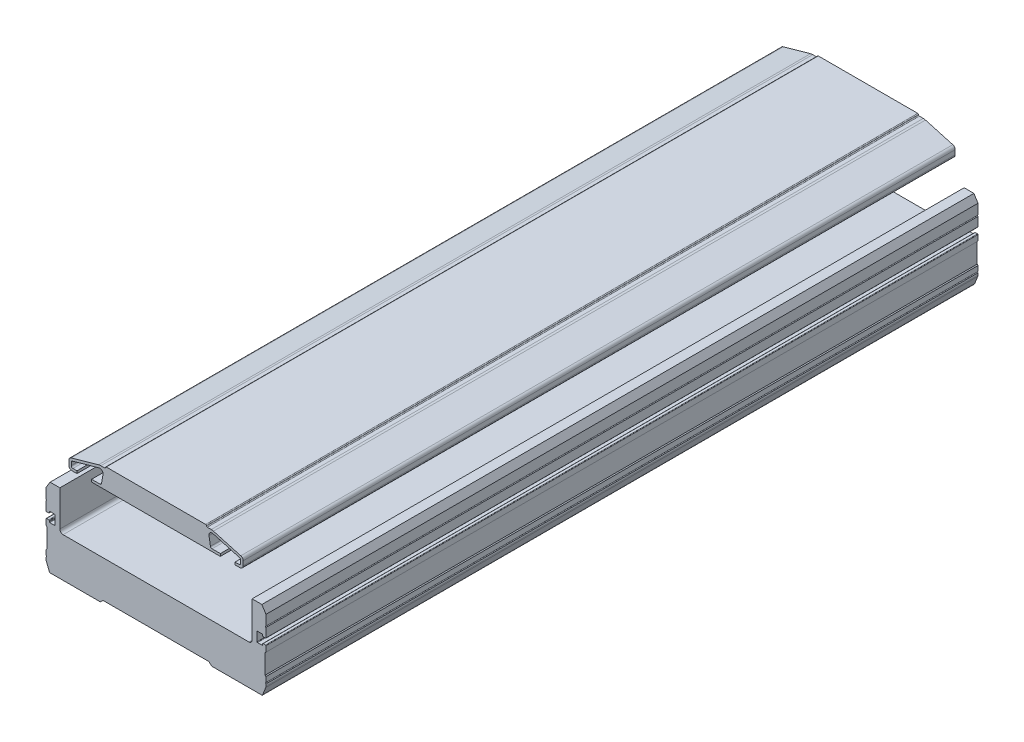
from build123d import *

# Parameters (mm, degrees)
EXTRUDE_1_DEPTH             = 437
EXTRUDE_1_2_DEPTH           = 437
HOLE_WIZARD_1_AT_2_COUNT    = 2
HOLE_WIZARD_1_AT_2_PITCH    = 106
HOLE_WIZARD_1_AT_3_COUNT    = 2
HOLE_WIZARD_1_AT_3_PITCH    = 145.725769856
HOLE_WIZARD_1_AT_4_COUNT    = 2
HOLE_WIZARD_1_AT_4_PITCH    = 100
HOLE_WIZARD_1_AT_5_COUNT    = 2
HOLE_WIZARD_1_AT_5_PITCH    = 318.176051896
HOLE_WIZARD_1_AT_6_COUNT    = 2
HOLE_WIZARD_1_AT_6_PITCH    = 300
HOLE_WIZARD_M6_0_AT_2_COUNT = 2
HOLE_WIZARD_M6_0_AT_2_PITCH = 106
HOLE_WIZARD_M6_0_AT_3_COUNT = 2
HOLE_WIZARD_M6_0_AT_3_PITCH = 100
HOLE_WIZARD_M6_0_AT_4_COUNT = 2
HOLE_WIZARD_M6_0_AT_4_PITCH = 145.725769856
HOLE_WIZARD_M6_0_AT_5_COUNT = 2
HOLE_WIZARD_M6_0_AT_5_PITCH = 318.176051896
HOLE_WIZARD_M6_0_AT_6_COUNT = 2
HOLE_WIZARD_M6_0_AT_6_PITCH = 300


with BuildPart() as part:
    # Sketch 1 → Extrude 1 (new body)
    with BuildSketch(Plane.XY):
        with BuildLine():
            Line((-39.5, 59.4), (39.5, 59.4))
            Line((39.5, 59.4), (39.5, 60.9))
            Line((39.5, 60.9), (34.4, 60.9))
            ThreePointArc((34.4, 60.9), (33.754110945, 61.136568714), (33.413816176, 61.734345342))
            Line((33.413816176, 61.734345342), (32.536146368, 66.959334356))
            ThreePointArc((32.536146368, 66.959334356), (33.171932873, 68.778444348), (35.048529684, 69.216359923))
            Line((35.048529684, 69.216359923), (51.270007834, 64.667479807))
            ThreePointArc((51.270007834, 64.667479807), (51.79687133, 64.308770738), (52, 63.704621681))
            Line((52, 63.704621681), (52, 61.9))
            ThreePointArc((52, 61.9), (51.707106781, 61.192893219), (51, 60.9))
            Line((51, 60.9), (48.5, 60.9))
            Line((48.5, 60.9), (48.5, 59.4))
            Line((48.5, 59.4), (51.5, 59.4))
            ThreePointArc((51.5, 59.4), (52.914213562, 59.985786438), (53.5, 61.4))
            Line((53.5, 61.4), (53.5, 64.083697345))
            ThreePointArc((53.5, 64.083697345), (53.093742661, 65.291995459), (52.040015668, 66.009413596))
            Line((52.040015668, 66.009413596), (35.262246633, 70.714290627))
            ThreePointArc((35.262246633, 70.714290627), (34.593583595, 70.853355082), (33.912207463, 70.9))
            Line((33.912207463, 70.9), (31.5, 70.9))
            ThreePointArc((31.5, 70.9), (31.146446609, 71.046446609), (31, 71.4))
            ThreePointArc((31, 71.4), (30.853553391, 71.753553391), (30.5, 71.9))
            Line((30.5, 71.9), (-30.5, 71.9))
            ThreePointArc((-30.5, 71.9), (-30.853553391, 71.753553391), (-31, 71.4))
            ThreePointArc((-31, 71.4), (-31.146446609, 71.046446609), (-31.5, 70.9))
            Line((-31.5, 70.9), (-33.912207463, 70.9))
            ThreePointArc((-33.912207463, 70.9), (-34.593583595, 70.853355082), (-35.262246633, 70.714290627))
            Line((-35.262246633, 70.714290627), (-52.040015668, 66.009413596))
            ThreePointArc((-52.040015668, 66.009413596), (-53.093742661, 65.291995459), (-53.5, 64.083697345))
            Line((-53.5, 64.083697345), (-53.5, 61.4))
            ThreePointArc((-53.5, 61.4), (-52.914213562, 59.985786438), (-51.5, 59.4))
            Line((-51.5, 59.4), (-48.5, 59.4))
            Line((-48.5, 59.4), (-48.5, 60.9))
            Line((-48.5, 60.9), (-51, 60.9))
            ThreePointArc((-51, 60.9), (-51.707106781, 61.192893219), (-52, 61.9))
            Line((-52, 61.9), (-52, 63.704621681))
            ThreePointArc((-52, 63.704621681), (-51.79687133, 64.308770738), (-51.270007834, 64.667479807))
            Line((-51.270007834, 64.667479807), (-35.048529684, 69.216359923))
            ThreePointArc((-35.048529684, 69.216359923), (-33.171932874, 68.778444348), (-32.536146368, 66.959334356))
            Line((-32.536146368, 66.959334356), (-33.413816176, 61.734345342))
            ThreePointArc((-33.413816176, 61.734345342), (-33.754110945, 61.136568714), (-34.4, 60.9))
            Line((-34.4, 60.9), (-39.5, 60.9))
            Line((-39.5, 60.9), (-39.5, 59.4))
        make_face()
    extrude(amount=-EXTRUDE_1_DEPTH)


with BuildPart() as body_2:
    # Sketch 1 → Extrude 1 2 (new body)
    with BuildSketch(Plane.XY):
        with BuildLine():
            Line((-67, 22), (-67, 10))
            Line((-67, 10), (-67.5, 9.5))
            Line((-67.5, 9.5), (-67.5, 6.375))
            ThreePointArc((-67.5, 6.375), (-67.125, 6), (-67.5, 5.625))
            Line((-67.5, 5.625), (-67.49999984, 4.381168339))
            ThreePointArc((-67.49999984, 4.381168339), (-67.464614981, 4.007418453), (-67.360006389, 3.646865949))
            Line((-67.360006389, 3.646865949), (-65.506419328, -1.028852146))
            ThreePointArc((-65.506419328, -1.028852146), (-65.35722349, -1.328991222), (-65.16, -1.6))
            Line((-65.16, -1.6), (-34.1, -1.6))
            Line((-34.1, -1.6), (-32.5, 0))
            Line((-32.5, 0), (32.5, 0))
            Line((32.5, 0), (34.1, -1.6))
            Line((34.1, -1.6), (65.16, -1.6))
            ThreePointArc((65.16, -1.6), (65.35722349, -1.328991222), (65.506419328, -1.028852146))
            Line((65.506419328, -1.028852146), (67.360006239, 3.646865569))
            ThreePointArc((67.360006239, 3.646865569), (67.464614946, 4.007418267), (67.499999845, 4.381168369))
            Line((67.499999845, 4.381168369), (67.499999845, 5.625000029))
            ThreePointArc((67.499999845, 5.625000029), (67.124999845, 6.000000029), (67.499999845, 6.375000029))
            Line((67.499999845, 6.375000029), (67.499999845, 9.500000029))
            Line((67.499999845, 9.500000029), (66.999999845, 10.000000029))
            Line((66.999999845, 10.000000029), (66.999999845, 22.000000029))
            Line((66.999999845, 22.000000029), (67.499999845, 22.500000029))
            Line((67.499999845, 22.500000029), (67.499999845, 25.900000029))
            ThreePointArc((67.499999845, 25.900000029), (67.41213188, 26.112132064), (67.199999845, 26.200000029))
            Line((67.199999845, 26.200000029), (65.799999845, 26.200000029))
            ThreePointArc((65.799999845, 26.200000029), (65.587867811, 26.112132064), (65.499999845, 25.900000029))
            Line((65.499999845, 25.900000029), (65.499999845, 25.300000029))
            ThreePointArc((65.499999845, 25.300000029), (65.41213188, 25.087867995), (65.199999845, 25.000000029))
            Line((65.199999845, 25.000000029), (62.299999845, 25.000000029))
            ThreePointArc((62.299999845, 25.000000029), (62.087867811, 25.087867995), (61.999999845, 25.300000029))
            Line((61.999999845, 25.300000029), (61.999999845, 30.700000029))
            ThreePointArc((61.999999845, 30.700000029), (62.087867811, 30.912132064), (62.299999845, 31.000000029))
            Line((62.299999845, 31.000000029), (65.199999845, 31.000000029))
            ThreePointArc((65.199999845, 31.000000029), (65.41213188, 30.912132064), (65.499999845, 30.700000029))
            Line((65.499999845, 30.700000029), (65.499999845, 30.100000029))
            ThreePointArc((65.499999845, 30.100000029), (65.587867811, 29.887867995), (65.799999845, 29.800000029))
            Line((65.799999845, 29.800000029), (67.199999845, 29.800000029))
            ThreePointArc((67.199999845, 29.800000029), (67.41213188, 29.887867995), (67.499999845, 30.100000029))
            Line((67.499999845, 30.100000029), (67.499999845, 35.625000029))
            ThreePointArc((67.499999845, 35.625000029), (67.124999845, 36.000000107), (67.5, 36.375000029))
            Line((67.5, 36.375000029), (67.5, 42.6))
            Line((67.5, 42.6), (65, 46.6))
            Line((65, 46.6), (59, 46.6))
            Line((59, 46.6), (59, 24.7))
            ThreePointArc((59, 24.7), (58.414213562, 23.285786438), (57, 22.7))
            Line((57, 22.7), (-57, 22.7))
            ThreePointArc((-57, 22.7), (-58.414213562, 23.285786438), (-59, 24.7))
            Line((-59, 24.7), (-59, 46.6))
            Line((-59, 46.6), (-65, 46.6))
            Line((-65, 46.6), (-67.5, 42.6))
            Line((-67.5, 42.6), (-67.5, 36.375))
            ThreePointArc((-67.5, 36.375), (-67.125, 36), (-67.5, 35.625))
            Line((-67.5, 35.625), (-67.5, 30.1))
            ThreePointArc((-67.5, 30.1), (-67.412132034, 29.887867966), (-67.2, 29.8))
            Line((-67.2, 29.8), (-65.8, 29.8))
            ThreePointArc((-65.8, 29.8), (-65.587867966, 29.887867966), (-65.5, 30.1))
            Line((-65.5, 30.1), (-65.5, 30.7))
            ThreePointArc((-65.5, 30.7), (-65.412132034, 30.912132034), (-65.2, 31))
            Line((-65.2, 31), (-62.3, 31))
            ThreePointArc((-62.3, 31), (-62.087867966, 30.912132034), (-62, 30.7))
            Line((-62, 30.7), (-62, 25.3))
            ThreePointArc((-62, 25.3), (-62.087867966, 25.087867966), (-62.3, 25))
            Line((-62.3, 25), (-65.2, 25))
            ThreePointArc((-65.2, 25), (-65.412132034, 25.087867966), (-65.5, 25.3))
            Line((-65.5, 25.3), (-65.5, 25.9))
            ThreePointArc((-65.5, 25.9), (-65.587867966, 26.112132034), (-65.8, 26.2))
            Line((-65.8, 26.2), (-67.2, 26.2))
            ThreePointArc((-67.2, 26.2), (-67.412132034, 26.112132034), (-67.5, 25.9))
            Line((-67.5, 25.9), (-67.5, 22.5))
            Line((-67.5, 22.5), (-67, 22))
        make_face()
    extrude(amount=-EXTRUDE_1_2_DEPTH)

    # Sketch 4 → Hole Wizard 1 (revolve, cut)
    with BuildSketch(Plane(origin=(-53, 46.6, -365.5), x_dir=(0, 0, 1), z_dir=(1, 0, 0))):
        Polygon((0, 0), (0, 48.2), (3.5, 48.2), (3.5, 41), (5.5, 41), (5.5, 0), align=None)
    hole_wizard_1 = revolve(axis=Axis((-53, 52.95, -365.5), (0, -1, 0)), mode=Mode.SUBTRACT)

    # Hole Wizard 1 at 2: Hole Wizard 1 ×2
    with Locations(*[(i * HOLE_WIZARD_1_AT_2_PITCH, 0, 0) for i in range(1, HOLE_WIZARD_1_AT_2_COUNT)]):
        add(hole_wizard_1, mode=Mode.SUBTRACT)

    # Hole Wizard 1 at 3: Hole Wizard 1 ×2
    with Locations(*[Vector(0.7273936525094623, 1.4469811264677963e-13, 0.6862204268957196) * (i * HOLE_WIZARD_1_AT_3_PITCH) for i in range(1, HOLE_WIZARD_1_AT_3_COUNT)]):
        add(hole_wizard_1, mode=Mode.SUBTRACT)

    # Hole Wizard 1 at 4: Hole Wizard 1 ×2
    with Locations(*[(0, 0, i * HOLE_WIZARD_1_AT_4_PITCH) for i in range(1, HOLE_WIZARD_1_AT_4_COUNT)]):
        add(hole_wizard_1, mode=Mode.SUBTRACT)

    # Hole Wizard 1 at 5: Hole Wizard 1 ×2
    with Locations(*[Vector(0.3331488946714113, 6.627225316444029e-14, 0.9428742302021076) * (i * HOLE_WIZARD_1_AT_5_PITCH) for i in range(1, HOLE_WIZARD_1_AT_5_COUNT)]):
        add(hole_wizard_1, mode=Mode.SUBTRACT)

    # Hole Wizard 1 at 6: Hole Wizard 1 ×2
    with Locations(*[(0, 0, i * HOLE_WIZARD_1_AT_6_PITCH) for i in range(1, HOLE_WIZARD_1_AT_6_COUNT)]):
        add(hole_wizard_1, mode=Mode.SUBTRACT)

    # Sketch 6 → Hole Wizard M6 _0 (revolve, cut)
    with BuildSketch(Plane(origin=(-53, -1.6, -375.5), x_dir=(0, 0, -1), z_dir=(1, 0, 0))):
        Polygon((0, 0), (0, 16.502151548), (2.5, 15), (2.5, 0), align=None)
    hole_wizard_m6_0 = revolve(axis=Axis((-53, -7.95, -375.5), (0, 1, 0)), mode=Mode.SUBTRACT)

    # Hole Wizard M6 _0 at 2: Hole Wizard M6 _0 ×2
    with Locations(*[(i * HOLE_WIZARD_M6_0_AT_2_PITCH, 0, 0) for i in range(1, HOLE_WIZARD_M6_0_AT_2_COUNT)]):
        add(hole_wizard_m6_0, mode=Mode.SUBTRACT)

    # Hole Wizard M6 _0 at 3: Hole Wizard M6 _0 ×2
    with Locations(*[(0, 0, i * HOLE_WIZARD_M6_0_AT_3_PITCH) for i in range(1, HOLE_WIZARD_M6_0_AT_3_COUNT)]):
        add(hole_wizard_m6_0, mode=Mode.SUBTRACT)

    # Hole Wizard M6 _0 at 4: Hole Wizard M6 _0 ×2
    with Locations(*[Vector(0.7273936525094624, 0, 0.6862204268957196) * (i * HOLE_WIZARD_M6_0_AT_4_PITCH) for i in range(1, HOLE_WIZARD_M6_0_AT_4_COUNT)]):
        add(hole_wizard_m6_0, mode=Mode.SUBTRACT)

    # Hole Wizard M6 _0 at 5: Hole Wizard M6 _0 ×2
    with Locations(*[Vector(0.3331488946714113, 0, 0.9428742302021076) * (i * HOLE_WIZARD_M6_0_AT_5_PITCH) for i in range(1, HOLE_WIZARD_M6_0_AT_5_COUNT)]):
        add(hole_wizard_m6_0, mode=Mode.SUBTRACT)

    # Hole Wizard M6 _0 at 6: Hole Wizard M6 _0 ×2
    with Locations(*[(0, 0, i * HOLE_WIZARD_M6_0_AT_6_PITCH) for i in range(1, HOLE_WIZARD_M6_0_AT_6_COUNT)]):
        add(hole_wizard_m6_0, mode=Mode.SUBTRACT)


solid = Compound([part.part, body_2.part])
